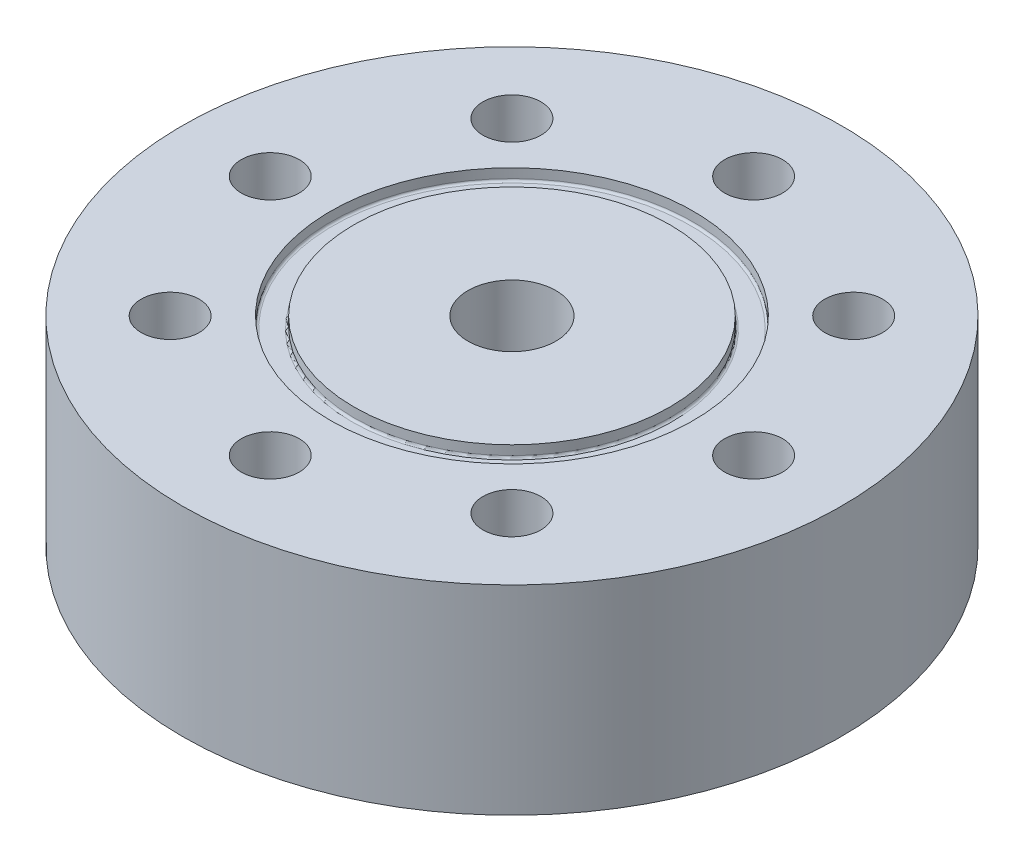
from build123d import *

# Parameters (mm, degrees)
SKETCH2_R                 = 37.5
OUTER_CYLINDER_DEPTH      = 22.7
SKETCH3_R                 = 8.93
NPT_HOLE_DEPTH            = 12.7
SKETCH4_R                 = 3.3
BOLT_HOLES_DEPTH          = 58.687000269
SKETCH5_R                 = 20.6375
SKETCH5_R_2               = 17.9705
O_RING_GROOVE_DEPTH       = 1.3208
FILLET1_R                 = 0.254
SKETCH6_R                 = 5
INLET_FLOW_DIAMETER_DEPTH = 10


with BuildPart() as part:
    # Sketch2 → Outer Cylinder (new body)
    with BuildSketch(Plane(origin=(0, 0, 0), x_dir=(1, 0, 0), z_dir=(0, 1, 0))):
        with Locations(Location((0, 0, 0), (0, 0, 270))):
            Circle(SKETCH2_R)
    extrude(amount=OUTER_CYLINDER_DEPTH)

    # Sketch3 → NPT Hole (cut)
    with BuildSketch(Plane.XZ):
        with Locations(Location((0, 0, 0), (0, 0, 270))):
            Circle(SKETCH3_R)
    extrude(amount=-NPT_HOLE_DEPTH, mode=Mode.SUBTRACT)

    # Sketch4 → Bolt Holes (cut, through all)
    with BuildSketch(Plane.XZ):
        with Locations(Location((-27.5, 0, 0), (0, 0, 270))):
            Circle(SKETCH4_R)
        with Locations(Location((-19.445436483, 19.445436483, 0), (0, 0, 270))):
            Circle(SKETCH4_R)
        with Locations(Location((0, 27.5, 0), (0, 0, 270))):
            Circle(SKETCH4_R)
        with Locations(Location((19.445436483, 19.445436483, 0), (0, 0, 270))):
            Circle(SKETCH4_R)
        with Locations(Location((27.5, 0, 0), (0, 0, 270))):
            Circle(SKETCH4_R)
        with Locations(Location((19.445436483, -19.445436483, 0), (0, 0, 270))):
            Circle(SKETCH4_R)
        with Locations(Location((0, -27.5, 0), (0, 0, 270))):
            Circle(SKETCH4_R)
        with Locations(Location((-19.445436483, -19.445436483, 0), (0, 0, 270))):
            Circle(SKETCH4_R)
    extrude(amount=-BOLT_HOLES_DEPTH, mode=Mode.SUBTRACT)

    # Sketch5 → O-Ring Groove (cut)
    with BuildSketch(Plane(origin=(0, 22.7, 0), x_dir=(1, 0, 0), z_dir=(0, 1, 0))):
        with Locations(Location((0, 0, 0), (0, 0, 270))):
            Circle(SKETCH5_R)
        with Locations(Location((0, 0, 0), (0, 0, 270))):
            Circle(SKETCH5_R_2, mode=Mode.SUBTRACT)
    extrude(amount=-O_RING_GROOVE_DEPTH, mode=Mode.SUBTRACT)

    # Fillet1
    fillet1_edges = [part.edges().sort_by_distance(p)[0] for p in [
        (0, 21.3792, -20.6375),
        (0, 21.3792, -17.9705),
    ]]
    fillet(fillet1_edges, radius=FILLET1_R)

    # Sketch6 → Inlet Flow Diameter (cut)
    with BuildSketch(Plane(origin=(0, 22.7, 0), x_dir=(1, 0, 0), z_dir=(0, 1, 0))):
        with Locations(Location((0, 0, 0), (0, 0, 270))):
            Circle(SKETCH6_R)
    extrude(amount=-INLET_FLOW_DIAMETER_DEPTH, mode=Mode.SUBTRACT)


solid = part.part
